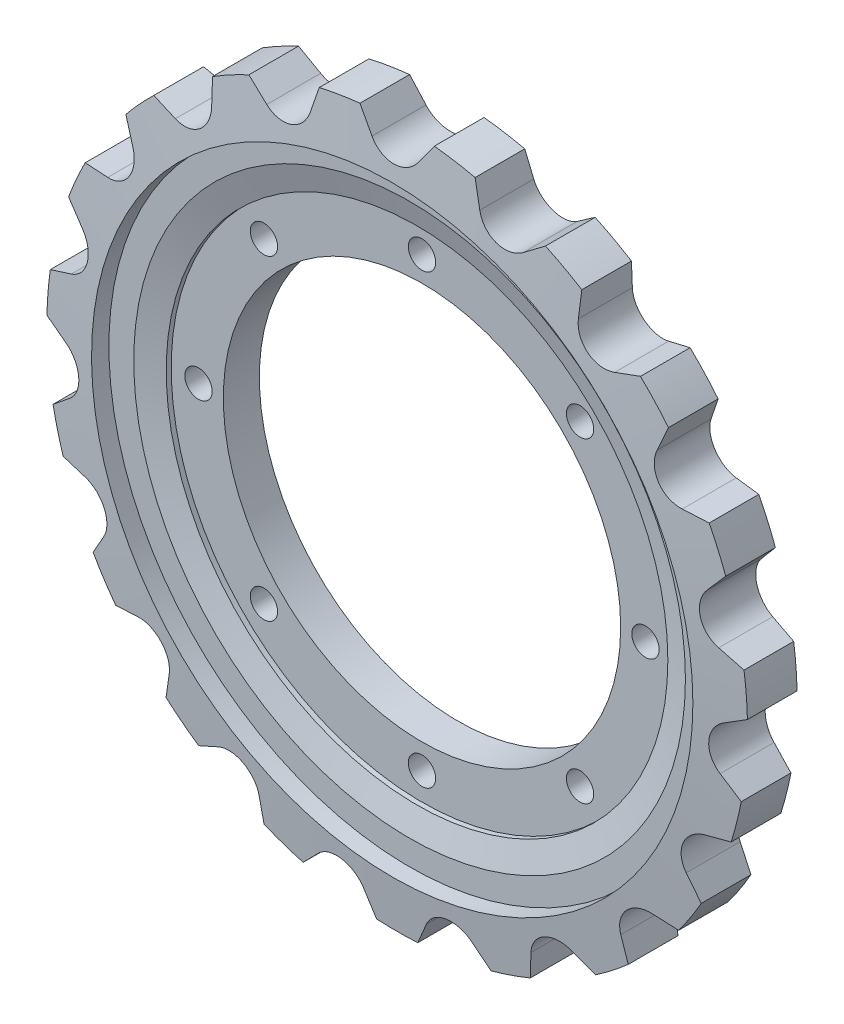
from build123d import *

# Parameters (mm, degrees)
D_GAGEMENT_M101_D            = 11
R_P_TITION_CIRCULAIRE1_COUNT = 8
ENL_V_MAT_EXTRU_1_DEPTH      = 202.262418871


with BuildPart() as part:
    # Esquisse1 → R_volution1 (revolve)
    with BuildSketch(Plane(origin=(0, 0, 0), x_dir=(0, 0, -1), z_dir=(1, 0, 0)), mode=Mode.PRIVATE) as r_volution1_sk:
        Polygon((0, 80), (0, 111), (-9.043756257, 111), (-9.5, 112.532218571), (-9.5, 121.075), (-2.5, 121.075), (-4.5, 141.075), (-24.5, 141.075), (-26.5, 121.075), (-19.5, 121.075), (-19.5, 111.075), (-16.5, 101), (-14.5, 101), (-14.5, 80), align=None)
    revolve(r_volution1_sk.sketch.rotate(Axis((0, 0, 36.781257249), (0, 0, -1)), 90), axis=Axis((0, 0, 36.781257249), (0, 0, -1)))

    # D_gagement M101 (through all)
    with Locations(Plane(origin=(0, 0, 0), x_dir=(-1, 0, 0), z_dir=(0, 0, -1))):
        with Locations((0, 90)):
            d_gagement_m101 = Hole(D_GAGEMENT_M101_D / 2)

    # R_p_tition circulaire1: D_gagement M101 ×8 about axis
    r_p_tition_circulaire1_axis = Axis((0, 0, 0), (0, 0, 1))
    for i in range(1, R_P_TITION_CIRCULAIRE1_COUNT):
        add(d_gagement_m101.rotate(r_p_tition_circulaire1_axis, i * 360 / R_P_TITION_CIRCULAIRE1_COUNT), mode=Mode.SUBTRACT)

    # Esquisse5 → Enl_v. mat.-Extru.1 (cut, through all)
    with BuildSketch(Plane.XY):
        with BuildLine():
            Line((-9.2564181, 132.108586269), (-14.97655619, 140.27779008))
            ThreePointArc((-14.97655619, 140.27779008), (0, 141.075), (14.97655619, 140.27779008))
            Line((14.97655619, 140.27779008), (9.2564181, 132.108586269))
            ThreePointArc((9.2564181, 132.108586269), (0, 127.29), (-9.2564181, 132.108586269))
        make_face()
        with BuildLine():
            Line((34.140708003, 127.956132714), (31.383038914, 137.540032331))
            ThreePointArc((31.383038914, 137.540032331), (45.806977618, 133.431167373), (59.713209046, 127.81427264))
            Line((59.713209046, 127.81427264), (51.650467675, 121.945024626))
            ThreePointArc((51.650467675, 121.945024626), (41.330995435, 120.393076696), (34.140708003, 127.956132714))
        make_face()
        with BuildLine():
            Line((73.838158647, 109.937646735), (74.341794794, 119.897677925))
            ThreePointArc((74.341794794, 119.897677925), (86.650058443, 111.327997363), (97.979009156, 101.500095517))
            Line((97.979009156, 101.500095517), (88.447387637, 98.566827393))
            ThreePointArc((88.447387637, 98.566827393), (78.183136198, 100.449695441), (73.838158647, 109.937646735))
        make_face()
        with BuildLine():
            Line((105.534099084, 80.005710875), (109.244463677, 89.262549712))
            ThreePointArc((109.244463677, 89.262549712), (118.103260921, 77.160711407), (125.627263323, 64.186808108))
            Line((125.627263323, 64.186808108), (115.659660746, 64.50738499))
            ThreePointArc((115.659660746, 64.50738499), (106.562921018, 69.621031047), (105.534099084, 80.005710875))
        make_face()
        with BuildLine():
            Line((125.793782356, 41.403914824), (132.308799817, 48.954439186))
            ThreePointArc((132.308799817, 48.954439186), (136.758142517, 34.631865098), (139.661854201, 19.91788408))
            Line((139.661854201, 19.91788408), (130.338414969, 23.457566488))
            ThreePointArc((130.338414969, 23.457566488), (123.394959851, 31.247847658), (125.793782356, 41.403914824))
        make_face()
        with BuildLine():
            Line((132.421757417, -1.684637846), (141.035424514, 3.341355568))
            ThreePointArc((141.035424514, 3.341355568), (140.593157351, -11.649881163), (138.561916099, -26.509451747))
            Line((138.561916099, -26.509451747), (130.892979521, -20.134243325))
            ThreePointArc((130.892979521, -20.134243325), (126.855240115, -10.511524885), (132.421757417, -1.684637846))
        make_face()
        with BuildLine():
            Line((124.699780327, -44.590633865), (134.478672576, -42.633815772))
            ThreePointArc((134.478672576, -42.633815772), (129.192722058, -56.669182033), (122.446644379, -70.064077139))
            Line((122.446644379, -70.064077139), (117.263258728, -61.544195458))
            ThreePointArc((117.263258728, -61.544195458), (116.56878675, -51.131810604), (124.699780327, -44.590633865))
        make_face()
        with BuildLine():
            Line((103.464647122, -82.66454281), (113.349069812, -83.988951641))
            ThreePointArc((113.349069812, -83.988951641), (103.792250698, -95.547497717), (93.062378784, -106.026172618))
            Line((93.062378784, -106.026172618), (90.926244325, -96.284879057))
            ThreePointArc((90.926244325, -96.284879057), (93.65029659, -86.211171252), (103.464647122, -82.66454281))
        make_face()
        with BuildLine():
            Line((71.017513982, -111.780465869), (79.936336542, -116.242581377))
            ThreePointArc((79.936336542, -116.242581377), (67.144278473, -124.071759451), (53.593360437, -130.498687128))
            Line((53.593360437, -130.498687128), (54.735960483, -120.591601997))
            ThreePointArc((54.735960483, -120.591601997), (60.58334366, -111.948213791), (71.017513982, -111.780465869))
        make_face()
        with BuildLine():
            Line((30.874531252, -128.783240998), (37.861260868, -135.899523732))
            ThreePointArc((37.861260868, -135.899523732), (23.220181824, -139.150920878), (8.3166699, -140.829643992))
            Line((8.3166699, -140.829643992), (12.614186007, -131.830353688))
            ThreePointArc((12.614186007, -131.830353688), (20.951245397, -125.55393031), (30.874531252, -128.783240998))
        make_face()
        with BuildLine():
            Line((-12.614186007, -131.830353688), (-8.3166699, -140.829643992))
            ThreePointArc((-8.3166699, -140.829643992), (-23.220181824, -139.150920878), (-37.861260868, -135.899523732))
            Line((-37.861260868, -135.899523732), (-30.874531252, -128.783240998))
            ThreePointArc((-30.874531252, -128.783240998), (-20.951245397, -125.55393031), (-12.614186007, -131.830353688))
        make_face()
        with BuildLine():
            Line((-54.735960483, -120.591601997), (-53.593360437, -130.498687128))
            ThreePointArc((-53.593360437, -130.498687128), (-67.144278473, -124.071759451), (-79.936336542, -116.242581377))
            Line((-79.936336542, -116.242581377), (-71.017513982, -111.780465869))
            ThreePointArc((-71.017513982, -111.780465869), (-60.58334366, -111.948213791), (-54.735960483, -120.591601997))
        make_face()
        with BuildLine():
            Line((-90.926244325, -96.284879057), (-93.062378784, -106.026172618))
            ThreePointArc((-93.062378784, -106.026172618), (-103.792250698, -95.547497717), (-113.349069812, -83.988951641))
            Line((-113.349069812, -83.988951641), (-103.464647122, -82.66454281))
            ThreePointArc((-103.464647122, -82.66454281), (-93.65029659, -86.211171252), (-90.926244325, -96.284879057))
        make_face()
        with BuildLine():
            Line((-117.263258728, -61.544195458), (-122.446644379, -70.064077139))
            ThreePointArc((-122.446644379, -70.064077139), (-129.192722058, -56.669182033), (-134.478672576, -42.633815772))
            Line((-134.478672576, -42.633815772), (-124.699780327, -44.590633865))
            ThreePointArc((-124.699780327, -44.590633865), (-116.56878675, -51.131810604), (-117.263258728, -61.544195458))
        make_face()
        with BuildLine():
            Line((-130.892979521, -20.134243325), (-138.561916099, -26.509451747))
            ThreePointArc((-138.561916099, -26.509451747), (-140.593157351, -11.649881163), (-141.035424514, 3.341355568))
            Line((-141.035424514, 3.341355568), (-132.421757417, -1.684637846))
            ThreePointArc((-132.421757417, -1.684637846), (-126.855240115, -10.511524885), (-130.892979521, -20.134243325))
        make_face()
        with BuildLine():
            Line((-130.338414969, 23.457566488), (-139.661854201, 19.91788408))
            ThreePointArc((-139.661854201, 19.91788408), (-136.758142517, 34.631865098), (-132.308799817, 48.954439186))
            Line((-132.308799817, 48.954439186), (-125.793782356, 41.403914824))
            ThreePointArc((-125.793782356, 41.403914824), (-123.394959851, 31.247847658), (-130.338414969, 23.457566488))
        make_face()
        with BuildLine():
            Line((-115.659660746, 64.50738499), (-125.627263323, 64.186808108))
            ThreePointArc((-125.627263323, 64.186808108), (-118.103260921, 77.160711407), (-109.244463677, 89.262549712))
            Line((-109.244463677, 89.262549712), (-105.534099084, 80.005710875))
            ThreePointArc((-105.534099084, 80.005710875), (-106.562921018, 69.621031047), (-115.659660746, 64.50738499))
        make_face()
        with BuildLine():
            Line((-88.447387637, 98.566827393), (-97.979009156, 101.500095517))
            ThreePointArc((-97.979009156, 101.500095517), (-86.650058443, 111.327997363), (-74.341794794, 119.897677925))
            Line((-74.341794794, 119.897677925), (-73.838158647, 109.937646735))
            ThreePointArc((-73.838158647, 109.937646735), (-78.183136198, 100.449695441), (-88.447387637, 98.566827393))
        make_face()
        with BuildLine():
            Line((-51.650467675, 121.945024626), (-59.713209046, 127.81427264))
            ThreePointArc((-59.713209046, 127.81427264), (-45.806977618, 133.431167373), (-31.383038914, 137.540032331))
            Line((-31.383038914, 137.540032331), (-34.140708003, 127.956132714))
            ThreePointArc((-34.140708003, 127.956132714), (-41.330995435, 120.393076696), (-51.650467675, 121.945024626))
        make_face()
    extrude(amount=ENL_V_MAT_EXTRU_1_DEPTH, mode=Mode.SUBTRACT)


solid = part.part
